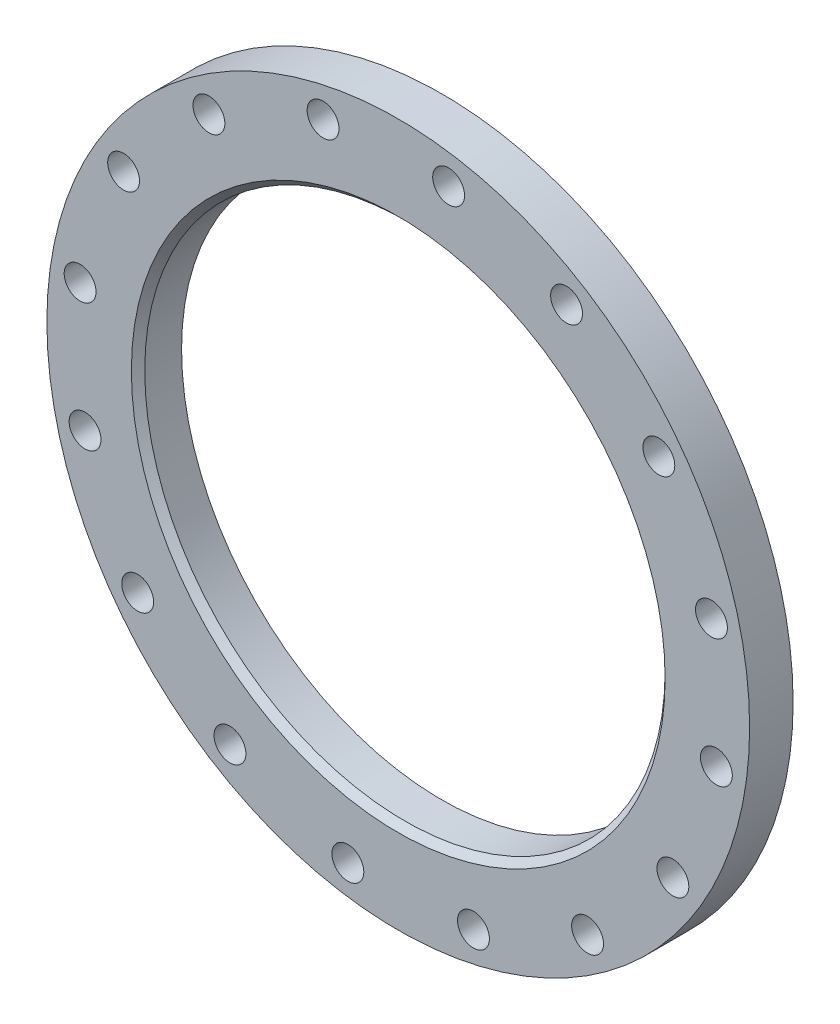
from build123d import *

# Parameters (mm, degrees)
SKETCH1_R          = 420
SKETCH1_R_2        = 311
EXTRUDE1_DEPTH     = 52
CHAMFER1_SIZE      = 8
SKETCH2_R          = 19.05
CUT_EXTRUDE1_DEPTH = 597.241561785
CIRPATTERN1_COUNT  = 16


with BuildPart() as part:
    # Sketch1 → Extrude1 (new body)
    with BuildSketch(Plane.XY):
        with Locations(Location((0, 0, 0), (0, 0, 180))):
            Circle(SKETCH1_R)
        with Locations(Location((0, 0, 0), (0, 0, 180))):
            Circle(SKETCH1_R_2, mode=Mode.SUBTRACT)
    extrude(amount=EXTRUDE1_DEPTH)

    # Chamfer1
    chamfer1_edges = [part.edges().sort_by_distance(p)[0] for p in [
        (311, 0, 52),
    ]]
    chamfer(chamfer1_edges, length=CHAMFER1_SIZE)

    # Sketch2 → Cut-Extrude1 (cut, through all)
    with BuildSketch(Plane.XY.offset(52)):
        with Locations((60.22726904, 380.260011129)):
            Circle(SKETCH2_R)
    cut_extrude1 = extrude(amount=-CUT_EXTRUDE1_DEPTH, mode=Mode.SUBTRACT)

    # CirPattern1: Cut-Extrude1 ×16 about axis
    cirpattern1_axis = Axis((0, 0, 0), (0, 0, 1))
    for i in range(1, CIRPATTERN1_COUNT):
        add(cut_extrude1.rotate(cirpattern1_axis, i * 360 / CIRPATTERN1_COUNT), mode=Mode.SUBTRACT)


solid = part.part
